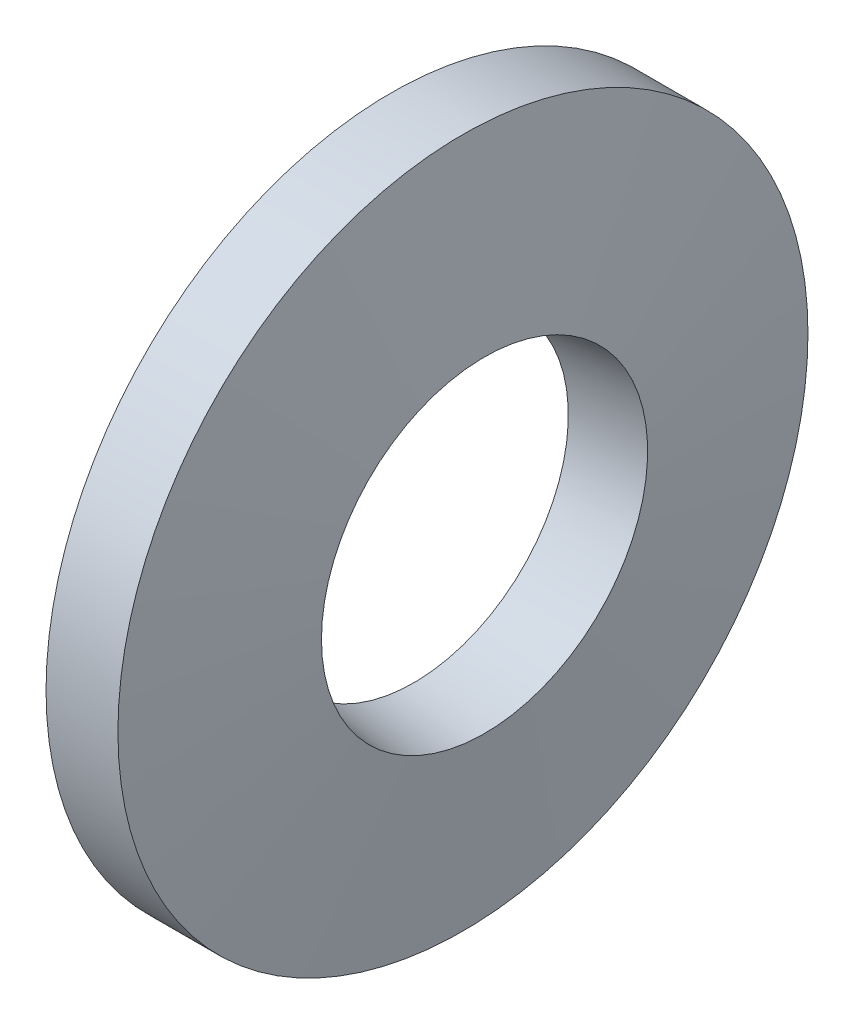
from build123d import *


with BuildPart() as part:
    # Skizze1 → Rotation1 (revolve)
    with BuildSketch(Plane.XY, mode=Mode.PRIVATE) as rotation1_sk:
        Polygon((0, 14.5), (0.95, 6.5), (3.92906877, 6.853764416), (3.021078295, 14.5), align=None)
    revolve(rotation1_sk.sketch.rotate(Axis((50, 0, 0), (-1, 0, 0)), 270), axis=Axis((50, 0, 0), (-1, 0, 0)))


solid = part.part
